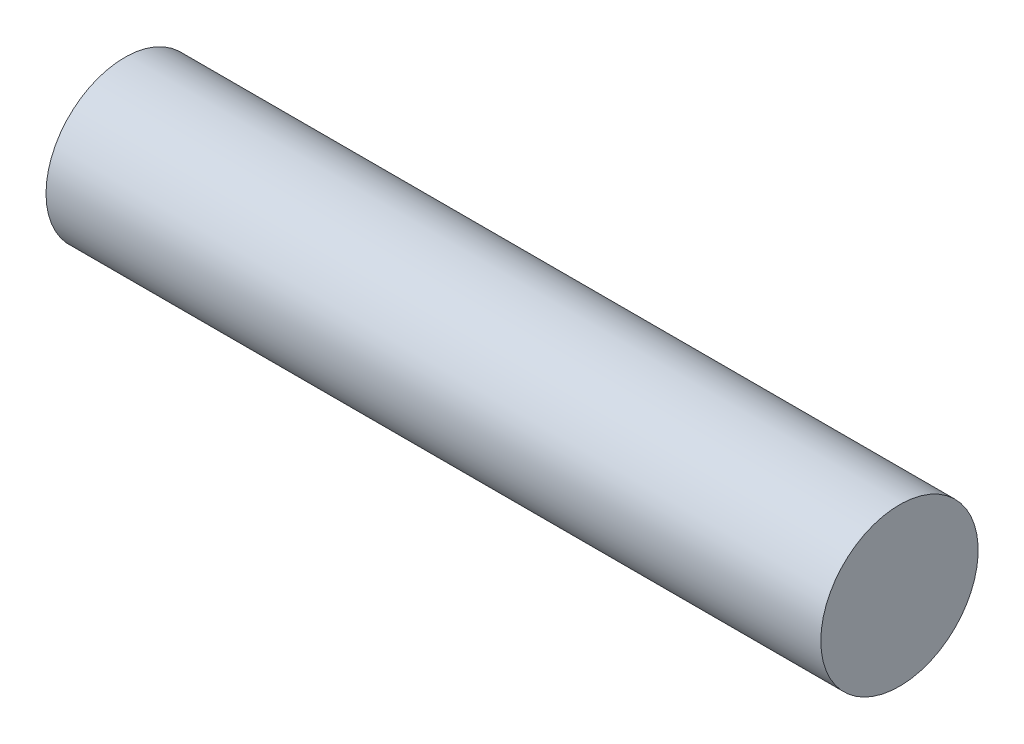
ISO-10303-21;
HEADER;
FILE_DESCRIPTION(('STEP AP214'),'2;1');
FILE_NAME('part.step','',(''),(''),'','','');
FILE_SCHEMA(('AUTOMOTIVE_DESIGN { 1 0 10303 214 1 1 1 1 }'));
ENDSEC;
DATA;
#1=APPLICATION_CONTEXT('core data for automotive mechanical design processes');
#2=APPLICATION_PROTOCOL_DEFINITION('international standard','automotive_design',2000,#1);
#3=PRODUCT_CONTEXT('',#1,'mechanical');
#4=PRODUCT('Part','Part','',(#3));
#5=PRODUCT_RELATED_PRODUCT_CATEGORY('part','',(#4));
#6=PRODUCT_DEFINITION_FORMATION('','',#4);
#7=PRODUCT_DEFINITION_CONTEXT('part definition',#1,'design');
#8=PRODUCT_DEFINITION('design','',#6,#7);
#9=PRODUCT_DEFINITION_SHAPE('','',#8);
#10=(LENGTH_UNIT() NAMED_UNIT(*) SI_UNIT(.MILLI.,.METRE.));
#11=(NAMED_UNIT(*) PLANE_ANGLE_UNIT() SI_UNIT($,.RADIAN.));
#12=(NAMED_UNIT(*) SI_UNIT($,.STERADIAN.) SOLID_ANGLE_UNIT());
#13=UNCERTAINTY_MEASURE_WITH_UNIT(LENGTH_MEASURE(1.E-05),#10,'distance_accuracy_value','');
#14=(GEOMETRIC_REPRESENTATION_CONTEXT(3) GLOBAL_UNCERTAINTY_ASSIGNED_CONTEXT((#13)) GLOBAL_UNIT_ASSIGNED_CONTEXT((#10,
#11,#12)) REPRESENTATION_CONTEXT('',''));
#15=CARTESIAN_POINT('',(0.,0.,0.));
#16=DIRECTION('',(0.,0.,1.));
#17=DIRECTION('',(1.,0.,0.));
#18=AXIS2_PLACEMENT_3D('',#15,#16,#17);
#19=CARTESIAN_POINT('',(-35.7529848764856,0.,0.));
#20=DIRECTION('',(-1.,0.,0.));
#21=DIRECTION('',(0.,0.,1.));
#22=AXIS2_PLACEMENT_3D('',#19,#20,#21);
#23=PLANE('',#22);
#24=CARTESIAN_POINT('',(-35.7529848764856,0.,0.));
#25=DIRECTION('',(-1.,0.,0.));
#26=DIRECTION('',(0.,0.,1.));
#27=AXIS2_PLACEMENT_3D('',#24,#25,#26);
#28=CIRCLE('',#27,7.39223217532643);
#29=CARTESIAN_POINT('',(-35.7529848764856,0.,7.39223217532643));
#30=VERTEX_POINT('',#29);
#31=EDGE_CURVE('E10',#30,#30,#28,.T.);
#32=ORIENTED_EDGE('',*,*,#31,.T.);
#33=EDGE_LOOP('',(#32));
#34=FACE_BOUND('',#33,.T.);
#35=ADVANCED_FACE('F33',(#34),#23,.T.);
#36=CARTESIAN_POINT('',(-46.7566802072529,0.,0.));
#37=DIRECTION('',(-1.,0.,0.));
#38=DIRECTION('',(0.,0.,1.));
#39=AXIS2_PLACEMENT_3D('',#36,#37,#38);
#40=CYLINDRICAL_SURFACE('',#39,7.39223217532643);
#41=CARTESIAN_POINT('',(37.0522869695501,0.,0.));
#42=DIRECTION('',(-1.,0.,0.));
#43=DIRECTION('',(0.,0.,1.));
#44=AXIS2_PLACEMENT_3D('',#41,#42,#43);
#45=CIRCLE('',#44,7.39223217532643);
#46=CARTESIAN_POINT('',(37.0522869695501,0.,7.39223217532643));
#47=VERTEX_POINT('',#46);
#48=EDGE_CURVE('E39',#47,#47,#45,.T.);
#49=ORIENTED_EDGE('',*,*,#48,.T.);
#50=EDGE_LOOP('',(#49));
#51=FACE_BOUND('',#50,.T.);
#52=ORIENTED_EDGE('',*,*,#31,.F.);
#53=EDGE_LOOP('',(#52));
#54=FACE_BOUND('',#53,.T.);
#55=ADVANCED_FACE('F45',(#51,#54),#40,.T.);
#56=CARTESIAN_POINT('',(37.0522869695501,0.,0.));
#57=DIRECTION('',(1.,0.,0.));
#58=DIRECTION('',(0.,0.,-1.));
#59=AXIS2_PLACEMENT_3D('',#56,#57,#58);
#60=PLANE('',#59);
#61=ORIENTED_EDGE('',*,*,#48,.F.);
#62=EDGE_LOOP('',(#61));
#63=FACE_BOUND('',#62,.T.);
#64=ADVANCED_FACE('F48',(#63),#60,.T.);
#65=CLOSED_SHELL('',(#35,#55,#64));
#66=MANIFOLD_SOLID_BREP('B2',#65);
#67=ADVANCED_BREP_SHAPE_REPRESENTATION('',(#18,#66),#14);
#68=SHAPE_DEFINITION_REPRESENTATION(#9,#67);
ENDSEC;
END-ISO-10303-21;
